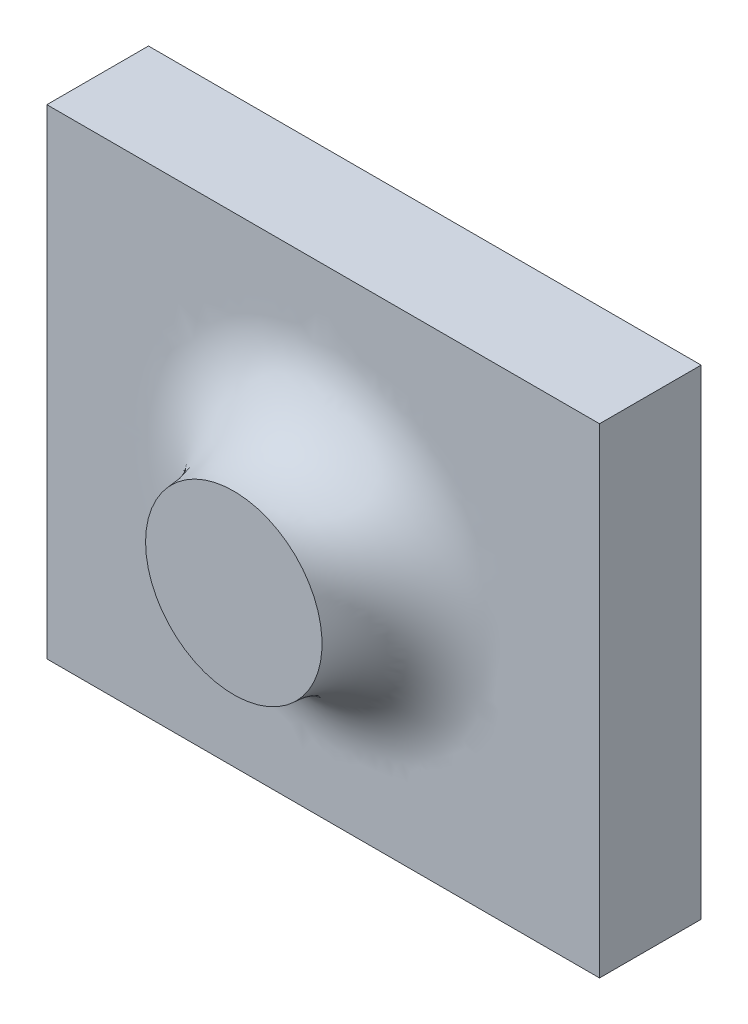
ISO-10303-21;
HEADER;
FILE_DESCRIPTION(('STEP AP214'),'2;1');
FILE_NAME('part.step','',(''),(''),'','','');
FILE_SCHEMA(('AUTOMOTIVE_DESIGN { 1 0 10303 214 1 1 1 1 }'));
ENDSEC;
DATA;
#1=APPLICATION_CONTEXT('core data for automotive mechanical design processes');
#2=APPLICATION_PROTOCOL_DEFINITION('international standard','automotive_design',2000,#1);
#3=PRODUCT_CONTEXT('',#1,'mechanical');
#4=PRODUCT('Part','Part','',(#3));
#5=PRODUCT_RELATED_PRODUCT_CATEGORY('part','',(#4));
#6=PRODUCT_DEFINITION_FORMATION('','',#4);
#7=PRODUCT_DEFINITION_CONTEXT('part definition',#1,'design');
#8=PRODUCT_DEFINITION('design','',#6,#7);
#9=PRODUCT_DEFINITION_SHAPE('','',#8);
#10=(LENGTH_UNIT() NAMED_UNIT(*) SI_UNIT(.MILLI.,.METRE.));
#11=(NAMED_UNIT(*) PLANE_ANGLE_UNIT() SI_UNIT($,.RADIAN.));
#12=(NAMED_UNIT(*) SI_UNIT($,.STERADIAN.) SOLID_ANGLE_UNIT());
#13=UNCERTAINTY_MEASURE_WITH_UNIT(LENGTH_MEASURE(1.E-05),#10,'distance_accuracy_value','');
#14=(GEOMETRIC_REPRESENTATION_CONTEXT(3) GLOBAL_UNCERTAINTY_ASSIGNED_CONTEXT((#13)) GLOBAL_UNIT_ASSIGNED_CONTEXT((#10,
#11,#12)) REPRESENTATION_CONTEXT('',''));
#15=CARTESIAN_POINT('',(0.,0.,0.));
#16=DIRECTION('',(0.,0.,1.));
#17=DIRECTION('',(1.,0.,0.));
#18=AXIS2_PLACEMENT_3D('',#15,#16,#17);
#19=CARTESIAN_POINT('',(-65.1047293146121,-56.5463505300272,-45.));
#20=DIRECTION('',(-1.,0.,0.));
#21=DIRECTION('',(0.,0.,1.));
#22=AXIS2_PLACEMENT_3D('',#19,#20,#21);
#23=PLANE('',#22);
#24=CARTESIAN_POINT('',(-65.1047293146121,56.5463505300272,-21.0635395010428));
#25=CARTESIAN_POINT('',(-65.1047293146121,45.3046434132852,-21.0635395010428));
#26=CARTESIAN_POINT('',(-65.1047293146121,34.0629362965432,-21.0635395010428));
#27=CARTESIAN_POINT('',(-65.1047293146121,9.59329922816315,-21.0635395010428));
#28=CARTESIAN_POINT('',(-65.1047293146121,-3.63463072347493,-21.0635395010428));
#29=CARTESIAN_POINT('',(-65.1047293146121,-30.0904906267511,-21.0635395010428));
#30=CARTESIAN_POINT('',(-65.1047293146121,-43.3184205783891,-21.0635395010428));
#31=CARTESIAN_POINT('',(-65.1047293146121,-56.5463505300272,-21.0635395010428));
#32=B_SPLINE_CURVE_WITH_KNOTS('',3,(#24,#25,#26,#27,#28,#29,#30,#31),.UNSPECIFIED.,.F.,.F.,(4,2,
2,4),(0.,33.725121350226,73.4089112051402,113.092701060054),.UNSPECIFIED.);
#33=CARTESIAN_POINT('',(-65.1047293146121,56.5463505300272,-21.0635395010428));
#34=VERTEX_POINT('',#33);
#35=CARTESIAN_POINT('',(-65.1047293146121,-56.5463505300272,-21.0635395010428));
#36=VERTEX_POINT('',#35);
#37=EDGE_CURVE('E50',#34,#36,#32,.T.);
#38=ORIENTED_EDGE('',*,*,#37,.F.);
#39=DIRECTION('',(0.,0.,1.));
#40=VECTOR('',#39,1.);
#41=CARTESIAN_POINT('',(-65.1047293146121,56.5463505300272,-45.));
#42=LINE('',#41,#40);
#43=CARTESIAN_POINT('',(-65.1047293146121,56.5463505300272,-45.));
#44=VERTEX_POINT('',#43);
#45=EDGE_CURVE('E11',#44,#34,#42,.T.);
#46=ORIENTED_EDGE('',*,*,#45,.F.);
#47=DIRECTION('',(0.,-1.,0.));
#48=VECTOR('',#47,1.);
#49=CARTESIAN_POINT('',(-65.1047293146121,-56.5463505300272,-45.));
#50=LINE('',#49,#48);
#51=CARTESIAN_POINT('',(-65.1047293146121,-56.5463505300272,-45.));
#52=VERTEX_POINT('',#51);
#53=EDGE_CURVE('E103',#44,#52,#50,.T.);
#54=ORIENTED_EDGE('',*,*,#53,.T.);
#55=DIRECTION('',(0.,0.,1.));
#56=VECTOR('',#55,1.);
#57=CARTESIAN_POINT('',(-65.1047293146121,-56.5463505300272,-45.));
#58=LINE('',#57,#56);
#59=EDGE_CURVE('E37',#52,#36,#58,.T.);
#60=ORIENTED_EDGE('',*,*,#59,.T.);
#61=EDGE_LOOP('',(#38,#46,#54,#60));
#62=FACE_BOUND('',#61,.T.);
#63=ADVANCED_FACE('F33',(#62),#23,.T.);
#64=CARTESIAN_POINT('',(-65.1047293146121,56.5463505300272,-45.));
#65=DIRECTION('',(0.,1.,0.));
#66=DIRECTION('',(0.,0.,1.));
#67=AXIS2_PLACEMENT_3D('',#64,#65,#66);
#68=PLANE('',#67);
#69=CARTESIAN_POINT('',(65.104729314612,56.5463505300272,-21.0635395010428));
#70=CARTESIAN_POINT('',(53.86302219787,56.5463505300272,-21.0635395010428));
#71=CARTESIAN_POINT('',(42.621315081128,56.5463505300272,-21.0635395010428));
#72=CARTESIAN_POINT('',(-0.781837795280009,56.5463505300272,-21.0635395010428));
#73=CARTESIAN_POINT('',(-32.943283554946,56.5463505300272,-21.0635395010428));
#74=CARTESIAN_POINT('',(-65.1047293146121,56.5463505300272,-21.0635395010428));
#75=B_SPLINE_CURVE_WITH_KNOTS('',3,(#69,#70,#71,#72,#73,#74),.UNSPECIFIED.,.F.,.F.,(4,2,4),(0.,
33.725121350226,130.209458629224),.UNSPECIFIED.);
#76=CARTESIAN_POINT('',(65.1047293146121,56.5463505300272,-21.0635395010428));
#77=VERTEX_POINT('',#76);
#78=EDGE_CURVE('E89',#77,#34,#75,.T.);
#79=ORIENTED_EDGE('',*,*,#78,.F.);
#80=DIRECTION('',(0.,0.,1.));
#81=VECTOR('',#80,1.);
#82=CARTESIAN_POINT('',(65.1047293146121,56.5463505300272,-45.));
#83=LINE('',#82,#81);
#84=CARTESIAN_POINT('',(65.1047293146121,56.5463505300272,-45.));
#85=VERTEX_POINT('',#84);
#86=EDGE_CURVE('E42',#85,#77,#83,.T.);
#87=ORIENTED_EDGE('',*,*,#86,.F.);
#88=DIRECTION('',(-1.,0.,0.));
#89=VECTOR('',#88,1.);
#90=CARTESIAN_POINT('',(-65.1047293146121,56.5463505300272,-45.));
#91=LINE('',#90,#89);
#92=EDGE_CURVE('E96',#85,#44,#91,.T.);
#93=ORIENTED_EDGE('',*,*,#92,.T.);
#94=ORIENTED_EDGE('',*,*,#45,.T.);
#95=EDGE_LOOP('',(#79,#87,#93,#94));
#96=FACE_BOUND('',#95,.T.);
#97=ADVANCED_FACE('F142',(#96),#68,.T.);
#98=CARTESIAN_POINT('',(65.1047293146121,-56.5463505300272,-45.));
#99=DIRECTION('',(1.,0.,0.));
#100=DIRECTION('',(0.,0.,-1.));
#101=AXIS2_PLACEMENT_3D('',#98,#99,#100);
#102=PLANE('',#101);
#103=CARTESIAN_POINT('',(65.1047293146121,-56.5463505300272,-21.0635395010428));
#104=CARTESIAN_POINT('',(65.1047293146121,-45.3046434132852,-21.0635395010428));
#105=CARTESIAN_POINT('',(65.1047293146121,-34.0629362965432,-21.0635395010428));
#106=CARTESIAN_POINT('',(65.1047293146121,3.6346307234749,-21.0635395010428));
#107=CARTESIAN_POINT('',(65.1047293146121,30.090490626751,-21.0635395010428));
#108=CARTESIAN_POINT('',(65.104729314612,56.5463505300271,-21.0635395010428));
#109=B_SPLINE_CURVE_WITH_KNOTS('',3,(#103,#104,#105,#106,#107,#108),.UNSPECIFIED.,.F.,.F.,(4,2,
4),(0.,33.725121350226,113.092701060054),.UNSPECIFIED.);
#110=CARTESIAN_POINT('',(65.104729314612,-56.5463505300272,-21.0635395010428));
#111=VERTEX_POINT('',#110);
#112=EDGE_CURVE('E76',#111,#77,#109,.T.);
#113=ORIENTED_EDGE('',*,*,#112,.F.);
#114=DIRECTION('',(0.,0.,1.));
#115=VECTOR('',#114,1.);
#116=CARTESIAN_POINT('',(65.1047293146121,-56.5463505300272,-45.));
#117=LINE('',#116,#115);
#118=CARTESIAN_POINT('',(65.1047293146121,-56.5463505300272,-45.));
#119=VERTEX_POINT('',#118);
#120=EDGE_CURVE('E87',#119,#111,#117,.T.);
#121=ORIENTED_EDGE('',*,*,#120,.F.);
#122=DIRECTION('',(0.,1.,0.));
#123=VECTOR('',#122,1.);
#124=CARTESIAN_POINT('',(65.1047293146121,-56.5463505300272,-45.));
#125=LINE('',#124,#123);
#126=EDGE_CURVE('E100',#119,#85,#125,.T.);
#127=ORIENTED_EDGE('',*,*,#126,.T.);
#128=ORIENTED_EDGE('',*,*,#86,.T.);
#129=EDGE_LOOP('',(#113,#121,#127,#128));
#130=FACE_BOUND('',#129,.T.);
#131=ADVANCED_FACE('F85',(#130),#102,.T.);
#132=CARTESIAN_POINT('',(-65.1047293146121,-56.5463505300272,-45.));
#133=DIRECTION('',(0.,-1.,0.));
#134=DIRECTION('',(0.,0.,-1.));
#135=AXIS2_PLACEMENT_3D('',#132,#133,#134);
#136=PLANE('',#135);
#137=CARTESIAN_POINT('',(-65.1047293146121,-56.5463505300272,-21.0635395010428));
#138=CARTESIAN_POINT('',(-53.8630221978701,-56.5463505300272,-21.0635395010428));
#139=CARTESIAN_POINT('',(-42.6213150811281,-56.5463505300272,-21.0635395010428));
#140=CARTESIAN_POINT('',(0.78183779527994,-56.5463505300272,-21.0635395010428));
#141=CARTESIAN_POINT('',(32.943283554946,-56.5463505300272,-21.0635395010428));
#142=CARTESIAN_POINT('',(65.1047293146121,-56.5463505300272,-21.0635395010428));
#143=B_SPLINE_CURVE_WITH_KNOTS('',3,(#137,#138,#139,#140,#141,#142),.UNSPECIFIED.,.F.,.F.,(4,2,
4),(0.,33.725121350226,130.209458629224),.UNSPECIFIED.);
#144=EDGE_CURVE('E72',#36,#111,#143,.T.);
#145=ORIENTED_EDGE('',*,*,#144,.F.);
#146=ORIENTED_EDGE('',*,*,#59,.F.);
#147=DIRECTION('',(1.,0.,0.));
#148=VECTOR('',#147,1.);
#149=CARTESIAN_POINT('',(-65.1047293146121,-56.5463505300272,-45.));
#150=LINE('',#149,#148);
#151=EDGE_CURVE('E94',#52,#119,#150,.T.);
#152=ORIENTED_EDGE('',*,*,#151,.T.);
#153=ORIENTED_EDGE('',*,*,#120,.T.);
#154=EDGE_LOOP('',(#145,#146,#152,#153));
#155=FACE_BOUND('',#154,.T.);
#156=ADVANCED_FACE('F92',(#155),#136,.T.);
#157=CARTESIAN_POINT('',(-65.1047293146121,56.5463505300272,-45.));
#158=DIRECTION('',(0.,0.,-1.));
#159=DIRECTION('',(-1.,0.,0.));
#160=AXIS2_PLACEMENT_3D('',#157,#158,#159);
#161=PLANE('',#160);
#162=ORIENTED_EDGE('',*,*,#53,.F.);
#163=ORIENTED_EDGE('',*,*,#92,.F.);
#164=ORIENTED_EDGE('',*,*,#126,.F.);
#165=ORIENTED_EDGE('',*,*,#151,.F.);
#166=EDGE_LOOP('',(#162,#163,#164,#165));
#167=FACE_BOUND('',#166,.T.);
#168=ADVANCED_FACE('F119',(#167),#161,.T.);
#169=CARTESIAN_POINT('',(-20.7876696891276,0.,0.));
#170=CARTESIAN_POINT('',(-20.7876696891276,0.,-11.8150737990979));
#171=CARTESIAN_POINT('',(-28.91283185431,0.,-20.3928187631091));
#172=CARTESIAN_POINT('',(-40.71056922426,0.,-21.0326326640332));
#173=CARTESIAN_POINT('',(-40.8371674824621,0.,-21.0394983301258));
#174=CARTESIAN_POINT('',(-41.0904879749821,0.,-21.05094362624));
#175=CARTESIAN_POINT('',(-41.4708563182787,0.,-21.0635395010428));
#176=CARTESIAN_POINT('',(-41.7244248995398,0.,-21.0635395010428));
#177=CARTESIAN_POINT('',(-41.8512091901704,0.,-21.0635395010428));
#178=CARTESIAN_POINT('',(-41.9771958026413,0.,-21.0635395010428));
#179=CARTESIAN_POINT('',(-42.2291690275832,0.,-21.0635395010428));
#180=CARTESIAN_POINT('',(-42.607128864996,0.,-21.0635395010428));
#181=CARTESIAN_POINT('',(-42.8591020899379,0.,-21.0635395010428));
#182=CARTESIAN_POINT('',(-42.9850887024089,0.,-21.0635395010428));
#183=CARTESIAN_POINT('',(-71.3099490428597,0.,-21.0635395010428));
#184=CARTESIAN_POINT('',(-99.6348093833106,0.,-21.0635395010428));
#185=CARTESIAN_POINT('',(-127.959669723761,0.,-21.0635395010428));
#186=(BOUNDED_CURVE() B_SPLINE_CURVE(3,(#169,#170,#171,#172,#173,#174,#175,#176,#177,#178,#179,
#180,#181,#182,#183,#184,#185),.UNSPECIFIED.,.F.,.F.) B_SPLINE_CURVE_WITH_KNOTS((4,3,1,1,3,1,1,
3,4),(0.,0.249273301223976,0.25254599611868,0.255818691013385,0.259091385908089,
0.262343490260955,0.265595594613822,0.268847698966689,1.),
.UNSPECIFIED.) CURVE() GEOMETRIC_REPRESENTATION_ITEM() RATIONAL_B_SPLINE_CURVE((1.,
0.817333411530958,0.817333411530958,1.,1.,1.,1.,1.,1.,1.,1.,1.,1.,1.,1.,1.,1.)) REPRESENTATION_ITEM(''));
#187=CARTESIAN_POINT('',(0.,0.,-21.0635395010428));
#188=DIRECTION('',(0.,0.,-1.));
#189=AXIS1_PLACEMENT('',#187,#188);
#190=SURFACE_OF_REVOLUTION('',#186,#189);
#191=ORIENTED_EDGE('',*,*,#37,.T.);
#192=ORIENTED_EDGE('',*,*,#144,.T.);
#193=ORIENTED_EDGE('',*,*,#112,.T.);
#194=ORIENTED_EDGE('',*,*,#78,.T.);
#195=EDGE_LOOP('',(#191,#192,#193,#194));
#196=FACE_BOUND('',#195,.T.);
#197=CARTESIAN_POINT('',(0.,0.,0.));
#198=DIRECTION('',(0.,0.,-1.));
#199=DIRECTION('',(-1.,0.,0.));
#200=AXIS2_PLACEMENT_3D('',#197,#198,#199);
#201=CIRCLE('',#200,20.7876696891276);
#202=CARTESIAN_POINT('',(-20.7876696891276,0.,0.));
#203=VERTEX_POINT('',#202);
#204=EDGE_CURVE('E81',#203,#203,#201,.T.);
#205=ORIENTED_EDGE('',*,*,#204,.T.);
#206=EDGE_LOOP('',(#205));
#207=FACE_BOUND('',#206,.T.);
#208=ADVANCED_FACE('F74',(#196,#207),#190,.T.);
#209=CARTESIAN_POINT('',(-65.1047293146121,56.5463505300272,0.));
#210=DIRECTION('',(0.,0.,-1.));
#211=DIRECTION('',(-1.,0.,0.));
#212=AXIS2_PLACEMENT_3D('',#209,#210,#211);
#213=PLANE('',#212);
#214=ORIENTED_EDGE('',*,*,#204,.F.);
#215=EDGE_LOOP('',(#214));
#216=FACE_BOUND('',#215,.T.);
#217=ADVANCED_FACE('F118',(#216),#213,.F.);
#218=CLOSED_SHELL('',(#63,#97,#131,#156,#168,#208,#217));
#219=MANIFOLD_SOLID_BREP('B2',#218);
#220=ADVANCED_BREP_SHAPE_REPRESENTATION('',(#18,#219),#14);
#221=SHAPE_DEFINITION_REPRESENTATION(#9,#220);
ENDSEC;
END-ISO-10303-21;
